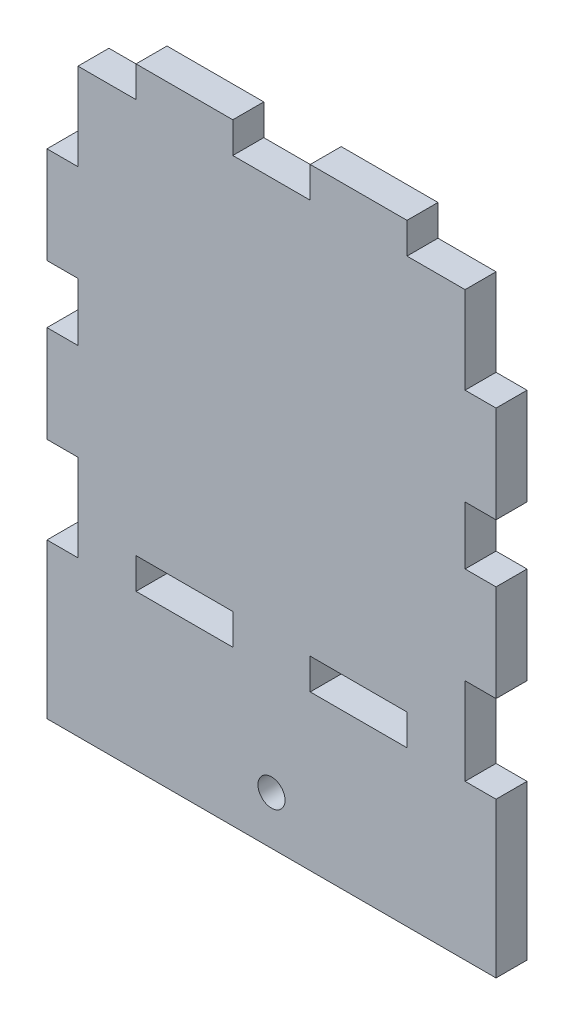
ISO-10303-21;
HEADER;
FILE_DESCRIPTION(('STEP AP214'),'2;1');
FILE_NAME('part.step','',(''),(''),'','','');
FILE_SCHEMA(('AUTOMOTIVE_DESIGN { 1 0 10303 214 1 1 1 1 }'));
ENDSEC;
DATA;
#1=APPLICATION_CONTEXT('core data for automotive mechanical design processes');
#2=APPLICATION_PROTOCOL_DEFINITION('international standard','automotive_design',2000,#1);
#3=PRODUCT_CONTEXT('',#1,'mechanical');
#4=PRODUCT('Part','Part','',(#3));
#5=PRODUCT_RELATED_PRODUCT_CATEGORY('part','',(#4));
#6=PRODUCT_DEFINITION_FORMATION('','',#4);
#7=PRODUCT_DEFINITION_CONTEXT('part definition',#1,'design');
#8=PRODUCT_DEFINITION('design','',#6,#7);
#9=PRODUCT_DEFINITION_SHAPE('','',#8);
#10=(LENGTH_UNIT() NAMED_UNIT(*) SI_UNIT(.MILLI.,.METRE.));
#11=(NAMED_UNIT(*) PLANE_ANGLE_UNIT() SI_UNIT($,.RADIAN.));
#12=(NAMED_UNIT(*) SI_UNIT($,.STERADIAN.) SOLID_ANGLE_UNIT());
#13=UNCERTAINTY_MEASURE_WITH_UNIT(LENGTH_MEASURE(1.E-05),#10,'distance_accuracy_value','');
#14=(GEOMETRIC_REPRESENTATION_CONTEXT(3) GLOBAL_UNCERTAINTY_ASSIGNED_CONTEXT((#13)) GLOBAL_UNIT_ASSIGNED_CONTEXT((#10,
#11,#12)) REPRESENTATION_CONTEXT('',''));
#15=CARTESIAN_POINT('',(0.,0.,0.));
#16=DIRECTION('',(0.,0.,1.));
#17=DIRECTION('',(1.,0.,0.));
#18=AXIS2_PLACEMENT_3D('',#15,#16,#17);
#19=CARTESIAN_POINT('',(80.,0.,-16.));
#20=DIRECTION('',(1.,0.,0.));
#21=DIRECTION('',(0.,0.,-1.));
#22=AXIS2_PLACEMENT_3D('',#19,#20,#21);
#23=PLANE('',#22);
#24=DIRECTION('',(0.,1.,0.));
#25=VECTOR('',#24,1.);
#26=CARTESIAN_POINT('',(80.,0.,0.));
#27=LINE('',#26,#25);
#28=CARTESIAN_POINT('',(80.,80.,0.));
#29=VERTEX_POINT('',#28);
#30=CARTESIAN_POINT('',(80.,96.,0.));
#31=VERTEX_POINT('',#30);
#32=EDGE_CURVE('E904',#29,#31,#27,.T.);
#33=ORIENTED_EDGE('',*,*,#32,.T.);
#34=DIRECTION('',(0.,0.,1.));
#35=VECTOR('',#34,1.);
#36=CARTESIAN_POINT('',(80.,96.,-16.));
#37=LINE('',#36,#35);
#38=CARTESIAN_POINT('',(80.,96.,-16.));
#39=VERTEX_POINT('',#38);
#40=EDGE_CURVE('E921',#39,#31,#37,.T.);
#41=ORIENTED_EDGE('',*,*,#40,.F.);
#42=DIRECTION('',(0.,1.,0.));
#43=VECTOR('',#42,1.);
#44=CARTESIAN_POINT('',(80.,0.,-16.));
#45=LINE('',#44,#43);
#46=CARTESIAN_POINT('',(80.,80.,-16.));
#47=VERTEX_POINT('',#46);
#48=EDGE_CURVE('E807',#47,#39,#45,.T.);
#49=ORIENTED_EDGE('',*,*,#48,.F.);
#50=DIRECTION('',(0.,0.,1.));
#51=VECTOR('',#50,1.);
#52=CARTESIAN_POINT('',(80.,80.,-16.));
#53=LINE('',#52,#51);
#54=EDGE_CURVE('E918',#47,#29,#53,.T.);
#55=ORIENTED_EDGE('',*,*,#54,.T.);
#56=EDGE_LOOP('',(#33,#41,#49,#55));
#57=FACE_BOUND('',#56,.T.);
#58=ADVANCED_FACE('F522',(#57),#23,.F.);
#59=CARTESIAN_POINT('',(0.,96.,-16.));
#60=DIRECTION('',(0.,-1.,0.));
#61=DIRECTION('',(1.,0.,0.));
#62=AXIS2_PLACEMENT_3D('',#59,#60,#61);
#63=PLANE('',#62);
#64=DIRECTION('',(1.,0.,0.));
#65=VECTOR('',#64,1.);
#66=CARTESIAN_POINT('',(0.,96.,0.));
#67=LINE('',#66,#65);
#68=CARTESIAN_POINT('',(30.,96.,0.));
#69=VERTEX_POINT('',#68);
#70=EDGE_CURVE('E901',#69,#31,#67,.T.);
#71=ORIENTED_EDGE('',*,*,#70,.F.);
#72=DIRECTION('',(0.,0.,1.));
#73=VECTOR('',#72,1.);
#74=CARTESIAN_POINT('',(30.,96.,-16.));
#75=LINE('',#74,#73);
#76=CARTESIAN_POINT('',(30.,96.,-16.));
#77=VERTEX_POINT('',#76);
#78=EDGE_CURVE('E923',#77,#69,#75,.T.);
#79=ORIENTED_EDGE('',*,*,#78,.F.);
#80=DIRECTION('',(1.,0.,0.));
#81=VECTOR('',#80,1.);
#82=CARTESIAN_POINT('',(0.,96.,-16.));
#83=LINE('',#82,#81);
#84=EDGE_CURVE('E1093',#77,#39,#83,.T.);
#85=ORIENTED_EDGE('',*,*,#84,.T.);
#86=ORIENTED_EDGE('',*,*,#40,.T.);
#87=EDGE_LOOP('',(#71,#79,#85,#86));
#88=FACE_BOUND('',#87,.T.);
#89=ADVANCED_FACE('F1104',(#88),#63,.T.);
#90=CARTESIAN_POINT('',(30.,0.,-16.));
#91=DIRECTION('',(1.,0.,0.));
#92=DIRECTION('',(0.,0.,-1.));
#93=AXIS2_PLACEMENT_3D('',#90,#91,#92);
#94=PLANE('',#93);
#95=DIRECTION('',(0.,1.,0.));
#96=VECTOR('',#95,1.);
#97=CARTESIAN_POINT('',(30.,0.,0.));
#98=LINE('',#97,#96);
#99=CARTESIAN_POINT('',(30.,80.,0.));
#100=VERTEX_POINT('',#99);
#101=EDGE_CURVE('E898',#100,#69,#98,.T.);
#102=ORIENTED_EDGE('',*,*,#101,.F.);
#103=DIRECTION('',(0.,0.,1.));
#104=VECTOR('',#103,1.);
#105=CARTESIAN_POINT('',(30.,80.,-16.));
#106=LINE('',#105,#104);
#107=CARTESIAN_POINT('',(30.,80.,-16.));
#108=VERTEX_POINT('',#107);
#109=EDGE_CURVE('E925',#108,#100,#106,.T.);
#110=ORIENTED_EDGE('',*,*,#109,.F.);
#111=DIRECTION('',(0.,1.,0.));
#112=VECTOR('',#111,1.);
#113=CARTESIAN_POINT('',(30.,0.,-16.));
#114=LINE('',#113,#112);
#115=EDGE_CURVE('E1090',#108,#77,#114,.T.);
#116=ORIENTED_EDGE('',*,*,#115,.T.);
#117=ORIENTED_EDGE('',*,*,#78,.T.);
#118=EDGE_LOOP('',(#102,#110,#116,#117));
#119=FACE_BOUND('',#118,.T.);
#120=ADVANCED_FACE('F1107',(#119),#94,.T.);
#121=CARTESIAN_POINT('',(0.,80.,-16.));
#122=DIRECTION('',(0.,-1.,0.));
#123=DIRECTION('',(0.,0.,-1.));
#124=AXIS2_PLACEMENT_3D('',#121,#122,#123);
#125=PLANE('',#124);
#126=DIRECTION('',(1.,0.,0.));
#127=VECTOR('',#126,1.);
#128=CARTESIAN_POINT('',(0.,80.,0.));
#129=LINE('',#128,#127);
#130=EDGE_CURVE('E895',#100,#29,#129,.T.);
#131=ORIENTED_EDGE('',*,*,#130,.T.);
#132=ORIENTED_EDGE('',*,*,#54,.F.);
#133=DIRECTION('',(1.,0.,0.));
#134=VECTOR('',#133,1.);
#135=CARTESIAN_POINT('',(0.,80.,-16.));
#136=LINE('',#135,#134);
#137=EDGE_CURVE('E1087',#108,#47,#136,.T.);
#138=ORIENTED_EDGE('',*,*,#137,.F.);
#139=ORIENTED_EDGE('',*,*,#109,.T.);
#140=EDGE_LOOP('',(#131,#132,#138,#139));
#141=FACE_BOUND('',#140,.T.);
#142=ADVANCED_FACE('F1110',(#141),#125,.F.);
#143=CARTESIAN_POINT('',(170.,0.,-16.));
#144=DIRECTION('',(1.,0.,0.));
#145=DIRECTION('',(0.,0.,-1.));
#146=AXIS2_PLACEMENT_3D('',#143,#144,#145);
#147=PLANE('',#146);
#148=DIRECTION('',(0.,1.,0.));
#149=VECTOR('',#148,1.);
#150=CARTESIAN_POINT('',(170.,0.,0.));
#151=LINE('',#150,#149);
#152=CARTESIAN_POINT('',(170.,80.,0.));
#153=VERTEX_POINT('',#152);
#154=CARTESIAN_POINT('',(170.,96.,0.));
#155=VERTEX_POINT('',#154);
#156=EDGE_CURVE('E913',#153,#155,#151,.T.);
#157=ORIENTED_EDGE('',*,*,#156,.T.);
#158=DIRECTION('',(0.,0.,1.));
#159=VECTOR('',#158,1.);
#160=CARTESIAN_POINT('',(170.,96.,-16.));
#161=LINE('',#160,#159);
#162=CARTESIAN_POINT('',(170.,96.,-16.));
#163=VERTEX_POINT('',#162);
#164=EDGE_CURVE('E532',#163,#155,#161,.T.);
#165=ORIENTED_EDGE('',*,*,#164,.F.);
#166=DIRECTION('',(0.,1.,0.));
#167=VECTOR('',#166,1.);
#168=CARTESIAN_POINT('',(170.,0.,-16.));
#169=LINE('',#168,#167);
#170=CARTESIAN_POINT('',(170.,80.,-16.));
#171=VERTEX_POINT('',#170);
#172=EDGE_CURVE('E794',#171,#163,#169,.T.);
#173=ORIENTED_EDGE('',*,*,#172,.F.);
#174=DIRECTION('',(0.,0.,1.));
#175=VECTOR('',#174,1.);
#176=CARTESIAN_POINT('',(170.,80.,-16.));
#177=LINE('',#176,#175);
#178=EDGE_CURVE('E12',#171,#153,#177,.T.);
#179=ORIENTED_EDGE('',*,*,#178,.T.);
#180=EDGE_LOOP('',(#157,#165,#173,#179));
#181=FACE_BOUND('',#180,.T.);
#182=ADVANCED_FACE('F1137',(#181),#147,.F.);
#183=CARTESIAN_POINT('',(0.,96.0000000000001,-16.));
#184=DIRECTION('',(0.,1.,0.));
#185=DIRECTION('',(-1.,0.,0.));
#186=AXIS2_PLACEMENT_3D('',#183,#184,#185);
#187=PLANE('',#186);
#188=DIRECTION('',(-1.,0.,0.));
#189=VECTOR('',#188,1.);
#190=CARTESIAN_POINT('',(0.,96.0000000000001,0.));
#191=LINE('',#190,#189);
#192=CARTESIAN_POINT('',(120.,96.,0.));
#193=VERTEX_POINT('',#192);
#194=EDGE_CURVE('E665',#155,#193,#191,.T.);
#195=ORIENTED_EDGE('',*,*,#194,.T.);
#196=DIRECTION('',(0.,0.,1.));
#197=VECTOR('',#196,1.);
#198=CARTESIAN_POINT('',(120.,96.,-16.));
#199=LINE('',#198,#197);
#200=CARTESIAN_POINT('',(120.,96.,-16.));
#201=VERTEX_POINT('',#200);
#202=EDGE_CURVE('E798',#201,#193,#199,.T.);
#203=ORIENTED_EDGE('',*,*,#202,.F.);
#204=DIRECTION('',(-1.,0.,0.));
#205=VECTOR('',#204,1.);
#206=CARTESIAN_POINT('',(0.,96.0000000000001,-16.));
#207=LINE('',#206,#205);
#208=EDGE_CURVE('E788',#163,#201,#207,.T.);
#209=ORIENTED_EDGE('',*,*,#208,.F.);
#210=ORIENTED_EDGE('',*,*,#164,.T.);
#211=EDGE_LOOP('',(#195,#203,#209,#210));
#212=FACE_BOUND('',#211,.T.);
#213=ADVANCED_FACE('F799',(#212),#187,.F.);
#214=CARTESIAN_POINT('',(120.,0.,-16.));
#215=DIRECTION('',(1.,0.,0.));
#216=DIRECTION('',(0.,0.,-1.));
#217=AXIS2_PLACEMENT_3D('',#214,#215,#216);
#218=PLANE('',#217);
#219=DIRECTION('',(0.,1.,0.));
#220=VECTOR('',#219,1.);
#221=CARTESIAN_POINT('',(120.,0.,0.));
#222=LINE('',#221,#220);
#223=CARTESIAN_POINT('',(120.,80.,0.));
#224=VERTEX_POINT('',#223);
#225=EDGE_CURVE('E910',#224,#193,#222,.T.);
#226=ORIENTED_EDGE('',*,*,#225,.F.);
#227=DIRECTION('',(0.,0.,1.));
#228=VECTOR('',#227,1.);
#229=CARTESIAN_POINT('',(120.,80.,-16.));
#230=LINE('',#229,#228);
#231=CARTESIAN_POINT('',(120.,80.,-16.));
#232=VERTEX_POINT('',#231);
#233=EDGE_CURVE('E802',#232,#224,#230,.T.);
#234=ORIENTED_EDGE('',*,*,#233,.F.);
#235=DIRECTION('',(0.,1.,0.));
#236=VECTOR('',#235,1.);
#237=CARTESIAN_POINT('',(120.,0.,-16.));
#238=LINE('',#237,#236);
#239=EDGE_CURVE('E793',#232,#201,#238,.T.);
#240=ORIENTED_EDGE('',*,*,#239,.T.);
#241=ORIENTED_EDGE('',*,*,#202,.T.);
#242=EDGE_LOOP('',(#226,#234,#240,#241));
#243=FACE_BOUND('',#242,.T.);
#244=ADVANCED_FACE('F804',(#243),#218,.T.);
#245=CARTESIAN_POINT('',(0.,80.,-16.));
#246=DIRECTION('',(0.,1.,0.));
#247=DIRECTION('',(0.,0.,1.));
#248=AXIS2_PLACEMENT_3D('',#245,#246,#247);
#249=PLANE('',#248);
#250=DIRECTION('',(-1.,0.,0.));
#251=VECTOR('',#250,1.);
#252=CARTESIAN_POINT('',(0.,80.,0.));
#253=LINE('',#252,#251);
#254=EDGE_CURVE('E907',#153,#224,#253,.T.);
#255=ORIENTED_EDGE('',*,*,#254,.F.);
#256=ORIENTED_EDGE('',*,*,#178,.F.);
#257=DIRECTION('',(-1.,0.,0.));
#258=VECTOR('',#257,1.);
#259=CARTESIAN_POINT('',(0.,80.,-16.));
#260=LINE('',#259,#258);
#261=EDGE_CURVE('E805',#171,#232,#260,.T.);
#262=ORIENTED_EDGE('',*,*,#261,.T.);
#263=ORIENTED_EDGE('',*,*,#233,.T.);
#264=EDGE_LOOP('',(#255,#256,#262,#263));
#265=FACE_BOUND('',#264,.T.);
#266=ADVANCED_FACE('F1115',(#265),#249,.T.);
#267=CARTESIAN_POINT('',(100.,25.,-16.));
#268=DIRECTION('',(0.,0.,1.));
#269=DIRECTION('',(1.,0.,0.));
#270=AXIS2_PLACEMENT_3D('',#267,#268,#269);
#271=CYLINDRICAL_SURFACE('',#270,7.);
#272=CARTESIAN_POINT('',(100.,25.,-16.));
#273=DIRECTION('',(0.,0.,1.));
#274=DIRECTION('',(1.,0.,0.));
#275=AXIS2_PLACEMENT_3D('',#272,#273,#274);
#276=CIRCLE('',#275,7.);
#277=CARTESIAN_POINT('',(107.,25.,-16.));
#278=VERTEX_POINT('',#277);
#279=EDGE_CURVE('E1012',#278,#278,#276,.T.);
#280=ORIENTED_EDGE('',*,*,#279,.F.);
#281=EDGE_LOOP('',(#280));
#282=FACE_BOUND('',#281,.T.);
#283=CARTESIAN_POINT('',(100.,25.,0.));
#284=DIRECTION('',(0.,0.,1.));
#285=DIRECTION('',(1.,0.,0.));
#286=AXIS2_PLACEMENT_3D('',#283,#284,#285);
#287=CIRCLE('',#286,7.);
#288=CARTESIAN_POINT('',(107.,25.,0.));
#289=VERTEX_POINT('',#288);
#290=EDGE_CURVE('E892',#289,#289,#287,.T.);
#291=ORIENTED_EDGE('',*,*,#290,.T.);
#292=EDGE_LOOP('',(#291));
#293=FACE_BOUND('',#292,.T.);
#294=ADVANCED_FACE('F1117',(#282,#293),#271,.F.);
#295=CARTESIAN_POINT('',(200.,0.,-16.));
#296=DIRECTION('',(1.,0.,0.));
#297=DIRECTION('',(0.,0.,-1.));
#298=AXIS2_PLACEMENT_3D('',#295,#296,#297);
#299=PLANE('',#298);
#300=DIRECTION('',(0.,1.,0.));
#301=VECTOR('',#300,1.);
#302=CARTESIAN_POINT('',(200.,0.,0.));
#303=LINE('',#302,#301);
#304=CARTESIAN_POINT('',(200.,255.,0.));
#305=VERTEX_POINT('',#304);
#306=CARTESIAN_POINT('',(200.,300.,0.));
#307=VERTEX_POINT('',#306);
#308=EDGE_CURVE('E860',#305,#307,#303,.T.);
#309=ORIENTED_EDGE('',*,*,#308,.F.);
#310=DIRECTION('',(0.,0.,1.));
#311=VECTOR('',#310,1.);
#312=CARTESIAN_POINT('',(200.,255.,-16.));
#313=LINE('',#312,#311);
#314=CARTESIAN_POINT('',(200.,255.,-16.));
#315=VERTEX_POINT('',#314);
#316=EDGE_CURVE('E944',#315,#305,#313,.T.);
#317=ORIENTED_EDGE('',*,*,#316,.F.);
#318=DIRECTION('',(0.,1.,0.));
#319=VECTOR('',#318,1.);
#320=CARTESIAN_POINT('',(200.,0.,-16.));
#321=LINE('',#320,#319);
#322=CARTESIAN_POINT('',(200.,300.,-16.));
#323=VERTEX_POINT('',#322);
#324=EDGE_CURVE('E1061',#315,#323,#321,.T.);
#325=ORIENTED_EDGE('',*,*,#324,.T.);
#326=DIRECTION('',(0.,0.,1.));
#327=VECTOR('',#326,1.);
#328=CARTESIAN_POINT('',(200.,300.,-16.));
#329=LINE('',#328,#327);
#330=EDGE_CURVE('E942',#323,#307,#329,.T.);
#331=ORIENTED_EDGE('',*,*,#330,.T.);
#332=EDGE_LOOP('',(#309,#317,#325,#331));
#333=FACE_BOUND('',#332,.T.);
#334=ADVANCED_FACE('F1123',(#333),#299,.T.);
#335=CARTESIAN_POINT('',(200.,175.,0.));
#336=VERTEX_POINT('',#335);
#337=CARTESIAN_POINT('',(200.,205.,0.));
#338=VERTEX_POINT('',#337);
#339=EDGE_CURVE('E861',#336,#338,#303,.T.);
#340=ORIENTED_EDGE('',*,*,#339,.F.);
#341=DIRECTION('',(0.,0.,1.));
#342=VECTOR('',#341,1.);
#343=CARTESIAN_POINT('',(200.,175.,-16.));
#344=LINE('',#343,#342);
#345=CARTESIAN_POINT('',(200.,175.,-16.));
#346=VERTEX_POINT('',#345);
#347=EDGE_CURVE('E953',#346,#336,#344,.T.);
#348=ORIENTED_EDGE('',*,*,#347,.F.);
#349=CARTESIAN_POINT('',(200.,205.,-16.));
#350=VERTEX_POINT('',#349);
#351=EDGE_CURVE('E1062',#346,#350,#321,.T.);
#352=ORIENTED_EDGE('',*,*,#351,.T.);
#353=DIRECTION('',(0.,0.,1.));
#354=VECTOR('',#353,1.);
#355=CARTESIAN_POINT('',(200.,205.,-16.));
#356=LINE('',#355,#354);
#357=EDGE_CURVE('E951',#350,#338,#356,.T.);
#358=ORIENTED_EDGE('',*,*,#357,.T.);
#359=EDGE_LOOP('',(#340,#348,#352,#358));
#360=FACE_BOUND('',#359,.T.);
#361=ADVANCED_FACE('F1165',(#360),#299,.T.);
#362=CARTESIAN_POINT('',(200.,80.,0.));
#363=VERTEX_POINT('',#362);
#364=CARTESIAN_POINT('',(200.,125.,0.));
#365=VERTEX_POINT('',#364);
#366=EDGE_CURVE('E856',#363,#365,#303,.T.);
#367=ORIENTED_EDGE('',*,*,#366,.F.);
#368=DIRECTION('',(0.,0.,1.));
#369=VECTOR('',#368,1.);
#370=CARTESIAN_POINT('',(200.,80.,-16.));
#371=LINE('',#370,#369);
#372=CARTESIAN_POINT('',(200.,80.,-16.));
#373=VERTEX_POINT('',#372);
#374=EDGE_CURVE('E962',#373,#363,#371,.T.);
#375=ORIENTED_EDGE('',*,*,#374,.F.);
#376=CARTESIAN_POINT('',(200.,125.,-16.));
#377=VERTEX_POINT('',#376);
#378=EDGE_CURVE('E1057',#373,#377,#321,.T.);
#379=ORIENTED_EDGE('',*,*,#378,.T.);
#380=DIRECTION('',(0.,0.,1.));
#381=VECTOR('',#380,1.);
#382=CARTESIAN_POINT('',(200.,125.,-16.));
#383=LINE('',#382,#381);
#384=EDGE_CURVE('E960',#377,#365,#383,.T.);
#385=ORIENTED_EDGE('',*,*,#384,.T.);
#386=EDGE_LOOP('',(#367,#375,#379,#385));
#387=FACE_BOUND('',#386,.T.);
#388=ADVANCED_FACE('F1167',(#387),#299,.T.);
#389=CARTESIAN_POINT('',(0.,300.,-16.));
#390=DIRECTION('',(0.,-1.,0.));
#391=DIRECTION('',(0.,0.,-1.));
#392=AXIS2_PLACEMENT_3D('',#389,#390,#391);
#393=PLANE('',#392);
#394=DIRECTION('',(1.,0.,0.));
#395=VECTOR('',#394,1.);
#396=CARTESIAN_POINT('',(0.,300.,0.));
#397=LINE('',#396,#395);
#398=CARTESIAN_POINT('',(170.,300.,0.));
#399=VERTEX_POINT('',#398);
#400=EDGE_CURVE('E819',#399,#307,#397,.T.);
#401=ORIENTED_EDGE('',*,*,#400,.T.);
#402=ORIENTED_EDGE('',*,*,#330,.F.);
#403=DIRECTION('',(1.,0.,0.));
#404=VECTOR('',#403,1.);
#405=CARTESIAN_POINT('',(0.,300.,-16.));
#406=LINE('',#405,#404);
#407=CARTESIAN_POINT('',(170.,300.,-16.));
#408=VERTEX_POINT('',#407);
#409=EDGE_CURVE('E1023',#408,#323,#406,.T.);
#410=ORIENTED_EDGE('',*,*,#409,.F.);
#411=DIRECTION('',(0.,0.,1.));
#412=VECTOR('',#411,1.);
#413=CARTESIAN_POINT('',(170.,300.,-16.));
#414=LINE('',#413,#412);
#415=EDGE_CURVE('E940',#408,#399,#414,.T.);
#416=ORIENTED_EDGE('',*,*,#415,.T.);
#417=EDGE_LOOP('',(#401,#402,#410,#416));
#418=FACE_BOUND('',#417,.T.);
#419=ADVANCED_FACE('F1149',(#418),#393,.F.);
#420=CARTESIAN_POINT('',(80.,300.,0.));
#421=VERTEX_POINT('',#420);
#422=CARTESIAN_POINT('',(120.,300.,0.));
#423=VERTEX_POINT('',#422);
#424=EDGE_CURVE('E818',#421,#423,#397,.T.);
#425=ORIENTED_EDGE('',*,*,#424,.T.);
#426=DIRECTION('',(0.,0.,1.));
#427=VECTOR('',#426,1.);
#428=CARTESIAN_POINT('',(120.,300.,-16.));
#429=LINE('',#428,#427);
#430=CARTESIAN_POINT('',(120.,300.,-16.));
#431=VERTEX_POINT('',#430);
#432=EDGE_CURVE('E934',#431,#423,#429,.T.);
#433=ORIENTED_EDGE('',*,*,#432,.F.);
#434=CARTESIAN_POINT('',(80.,300.,-16.));
#435=VERTEX_POINT('',#434);
#436=EDGE_CURVE('E1022',#435,#431,#406,.T.);
#437=ORIENTED_EDGE('',*,*,#436,.F.);
#438=DIRECTION('',(0.,0.,1.));
#439=VECTOR('',#438,1.);
#440=CARTESIAN_POINT('',(80.,300.,-16.));
#441=LINE('',#440,#439);
#442=EDGE_CURVE('E932',#435,#421,#441,.T.);
#443=ORIENTED_EDGE('',*,*,#442,.T.);
#444=EDGE_LOOP('',(#425,#433,#437,#443));
#445=FACE_BOUND('',#444,.T.);
#446=ADVANCED_FACE('F1143',(#445),#393,.F.);
#447=CARTESIAN_POINT('',(0.,300.,0.));
#448=VERTEX_POINT('',#447);
#449=CARTESIAN_POINT('',(30.,300.,0.));
#450=VERTEX_POINT('',#449);
#451=EDGE_CURVE('E815',#448,#450,#397,.T.);
#452=ORIENTED_EDGE('',*,*,#451,.T.);
#453=DIRECTION('',(0.,0.,1.));
#454=VECTOR('',#453,1.);
#455=CARTESIAN_POINT('',(30.,300.,-16.));
#456=LINE('',#455,#454);
#457=CARTESIAN_POINT('',(30.,300.,-16.));
#458=VERTEX_POINT('',#457);
#459=EDGE_CURVE('E526',#458,#450,#456,.T.);
#460=ORIENTED_EDGE('',*,*,#459,.F.);
#461=CARTESIAN_POINT('',(0.,300.,-16.));
#462=VERTEX_POINT('',#461);
#463=EDGE_CURVE('E1018',#462,#458,#406,.T.);
#464=ORIENTED_EDGE('',*,*,#463,.F.);
#465=DIRECTION('',(0.,0.,1.));
#466=VECTOR('',#465,1.);
#467=CARTESIAN_POINT('',(0.,300.,-16.));
#468=LINE('',#467,#466);
#469=EDGE_CURVE('E990',#462,#448,#468,.T.);
#470=ORIENTED_EDGE('',*,*,#469,.T.);
#471=EDGE_LOOP('',(#452,#460,#464,#470));
#472=FACE_BOUND('',#471,.T.);
#473=ADVANCED_FACE('F997',(#472),#393,.F.);
#474=CARTESIAN_POINT('',(0.,0.,-16.));
#475=DIRECTION('',(-1.,0.,0.));
#476=DIRECTION('',(0.,0.,1.));
#477=AXIS2_PLACEMENT_3D('',#474,#475,#476);
#478=PLANE('',#477);
#479=DIRECTION('',(0.,-1.,0.));
#480=VECTOR('',#479,1.);
#481=CARTESIAN_POINT('',(0.,0.,0.));
#482=LINE('',#481,#480);
#483=CARTESIAN_POINT('',(0.,125.,0.));
#484=VERTEX_POINT('',#483);
#485=CARTESIAN_POINT('',(0.,80.,0.));
#486=VERTEX_POINT('',#485);
#487=EDGE_CURVE('E823',#484,#486,#482,.T.);
#488=ORIENTED_EDGE('',*,*,#487,.F.);
#489=DIRECTION('',(0.,0.,1.));
#490=VECTOR('',#489,1.);
#491=CARTESIAN_POINT('',(0.,125.,-16.));
#492=LINE('',#491,#490);
#493=CARTESIAN_POINT('',(0.,125.,-16.));
#494=VERTEX_POINT('',#493);
#495=EDGE_CURVE('E975',#494,#484,#492,.T.);
#496=ORIENTED_EDGE('',*,*,#495,.F.);
#497=DIRECTION('',(0.,-1.,0.));
#498=VECTOR('',#497,1.);
#499=CARTESIAN_POINT('',(0.,0.,-16.));
#500=LINE('',#499,#498);
#501=CARTESIAN_POINT('',(0.,80.,-16.));
#502=VERTEX_POINT('',#501);
#503=EDGE_CURVE('E1028',#494,#502,#500,.T.);
#504=ORIENTED_EDGE('',*,*,#503,.T.);
#505=DIRECTION('',(0.,0.,1.));
#506=VECTOR('',#505,1.);
#507=CARTESIAN_POINT('',(0.,80.,-16.));
#508=LINE('',#507,#506);
#509=EDGE_CURVE('E973',#502,#486,#508,.T.);
#510=ORIENTED_EDGE('',*,*,#509,.T.);
#511=EDGE_LOOP('',(#488,#496,#504,#510));
#512=FACE_BOUND('',#511,.T.);
#513=ADVANCED_FACE('F1212',(#512),#478,.T.);
#514=CARTESIAN_POINT('',(0.,205.,0.));
#515=VERTEX_POINT('',#514);
#516=CARTESIAN_POINT('',(0.,175.,0.));
#517=VERTEX_POINT('',#516);
#518=EDGE_CURVE('E824',#515,#517,#482,.T.);
#519=ORIENTED_EDGE('',*,*,#518,.F.);
#520=DIRECTION('',(0.,0.,1.));
#521=VECTOR('',#520,1.);
#522=CARTESIAN_POINT('',(0.,205.,-16.));
#523=LINE('',#522,#521);
#524=CARTESIAN_POINT('',(0.,205.,-16.));
#525=VERTEX_POINT('',#524);
#526=EDGE_CURVE('E983',#525,#515,#523,.T.);
#527=ORIENTED_EDGE('',*,*,#526,.F.);
#528=CARTESIAN_POINT('',(0.,175.,-16.));
#529=VERTEX_POINT('',#528);
#530=EDGE_CURVE('E1029',#525,#529,#500,.T.);
#531=ORIENTED_EDGE('',*,*,#530,.T.);
#532=DIRECTION('',(0.,0.,1.));
#533=VECTOR('',#532,1.);
#534=CARTESIAN_POINT('',(0.,175.,-16.));
#535=LINE('',#534,#533);
#536=EDGE_CURVE('E981',#529,#517,#535,.T.);
#537=ORIENTED_EDGE('',*,*,#536,.T.);
#538=EDGE_LOOP('',(#519,#527,#531,#537));
#539=FACE_BOUND('',#538,.T.);
#540=ADVANCED_FACE('F1215',(#539),#478,.T.);
#541=CARTESIAN_POINT('',(0.,255.,0.));
#542=VERTEX_POINT('',#541);
#543=EDGE_CURVE('E817',#448,#542,#482,.T.);
#544=ORIENTED_EDGE('',*,*,#543,.F.);
#545=ORIENTED_EDGE('',*,*,#469,.F.);
#546=CARTESIAN_POINT('',(0.,255.,-16.));
#547=VERTEX_POINT('',#546);
#548=EDGE_CURVE('E1020',#462,#547,#500,.T.);
#549=ORIENTED_EDGE('',*,*,#548,.T.);
#550=DIRECTION('',(0.,0.,1.));
#551=VECTOR('',#550,1.);
#552=CARTESIAN_POINT('',(0.,255.,-16.));
#553=LINE('',#552,#551);
#554=EDGE_CURVE('E989',#547,#542,#553,.T.);
#555=ORIENTED_EDGE('',*,*,#554,.T.);
#556=EDGE_LOOP('',(#544,#545,#549,#555));
#557=FACE_BOUND('',#556,.T.);
#558=ADVANCED_FACE('F1172',(#557),#478,.T.);
#559=CARTESIAN_POINT('',(8.84708972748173E-13,255.000000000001,-16.));
#560=DIRECTION('',(0.,-1.,0.));
#561=DIRECTION('',(1.,0.,0.));
#562=AXIS2_PLACEMENT_3D('',#559,#560,#561);
#563=PLANE('',#562);
#564=DIRECTION('',(1.,0.,0.));
#565=VECTOR('',#564,1.);
#566=CARTESIAN_POINT('',(8.84708972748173E-13,255.000000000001,0.));
#567=LINE('',#566,#565);
#568=CARTESIAN_POINT('',(216.,255.,0.));
#569=VERTEX_POINT('',#568);
#570=EDGE_CURVE('E875',#305,#569,#567,.T.);
#571=ORIENTED_EDGE('',*,*,#570,.T.);
#572=DIRECTION('',(0.,0.,1.));
#573=VECTOR('',#572,1.);
#574=CARTESIAN_POINT('',(216.,255.,-16.));
#575=LINE('',#574,#573);
#576=CARTESIAN_POINT('',(216.,255.,-16.));
#577=VERTEX_POINT('',#576);
#578=EDGE_CURVE('E946',#577,#569,#575,.T.);
#579=ORIENTED_EDGE('',*,*,#578,.F.);
#580=DIRECTION('',(1.,0.,0.));
#581=VECTOR('',#580,1.);
#582=CARTESIAN_POINT('',(8.84708972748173E-13,255.000000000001,-16.));
#583=LINE('',#582,#581);
#584=EDGE_CURVE('E1074',#315,#577,#583,.T.);
#585=ORIENTED_EDGE('',*,*,#584,.F.);
#586=ORIENTED_EDGE('',*,*,#316,.T.);
#587=EDGE_LOOP('',(#571,#579,#585,#586));
#588=FACE_BOUND('',#587,.T.);
#589=ADVANCED_FACE('F1168',(#588),#563,.F.);
#590=CARTESIAN_POINT('',(216.,-1.19904086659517E-13,-16.));
#591=DIRECTION('',(-1.,0.,0.));
#592=DIRECTION('',(0.,-1.,0.));
#593=AXIS2_PLACEMENT_3D('',#590,#591,#592);
#594=PLANE('',#593);
#595=DIRECTION('',(0.,-1.,0.));
#596=VECTOR('',#595,1.);
#597=CARTESIAN_POINT('',(216.,-1.19904086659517E-13,0.));
#598=LINE('',#597,#596);
#599=CARTESIAN_POINT('',(216.,205.,0.));
#600=VERTEX_POINT('',#599);
#601=EDGE_CURVE('E872',#569,#600,#598,.T.);
#602=ORIENTED_EDGE('',*,*,#601,.T.);
#603=DIRECTION('',(0.,0.,1.));
#604=VECTOR('',#603,1.);
#605=CARTESIAN_POINT('',(216.,205.,-16.));
#606=LINE('',#605,#604);
#607=CARTESIAN_POINT('',(216.,205.,-16.));
#608=VERTEX_POINT('',#607);
#609=EDGE_CURVE('E949',#608,#600,#606,.T.);
#610=ORIENTED_EDGE('',*,*,#609,.F.);
#611=DIRECTION('',(0.,-1.,0.));
#612=VECTOR('',#611,1.);
#613=CARTESIAN_POINT('',(216.,-1.19904086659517E-13,-16.));
#614=LINE('',#613,#612);
#615=EDGE_CURVE('E1072',#577,#608,#614,.T.);
#616=ORIENTED_EDGE('',*,*,#615,.F.);
#617=ORIENTED_EDGE('',*,*,#578,.T.);
#618=EDGE_LOOP('',(#602,#610,#616,#617));
#619=FACE_BOUND('',#618,.T.);
#620=ADVANCED_FACE('F1171',(#619),#594,.F.);
#621=CARTESIAN_POINT('',(0.,205.,-16.));
#622=DIRECTION('',(0.,-1.,0.));
#623=DIRECTION('',(0.,0.,-1.));
#624=AXIS2_PLACEMENT_3D('',#621,#622,#623);
#625=PLANE('',#624);
#626=DIRECTION('',(1.,0.,0.));
#627=VECTOR('',#626,1.);
#628=CARTESIAN_POINT('',(0.,205.,0.));
#629=LINE('',#628,#627);
#630=EDGE_CURVE('E869',#338,#600,#629,.T.);
#631=ORIENTED_EDGE('',*,*,#630,.F.);
#632=ORIENTED_EDGE('',*,*,#357,.F.);
#633=DIRECTION('',(1.,0.,0.));
#634=VECTOR('',#633,1.);
#635=CARTESIAN_POINT('',(0.,205.,-16.));
#636=LINE('',#635,#634);
#637=EDGE_CURVE('E1069',#350,#608,#636,.T.);
#638=ORIENTED_EDGE('',*,*,#637,.T.);
#639=ORIENTED_EDGE('',*,*,#609,.T.);
#640=EDGE_LOOP('',(#631,#632,#638,#639));
#641=FACE_BOUND('',#640,.T.);
#642=ADVANCED_FACE('F1113',(#641),#625,.T.);
#643=CARTESIAN_POINT('',(0.,0.,0.));
#644=DIRECTION('',(0.,0.,1.));
#645=DIRECTION('',(1.,0.,0.));
#646=AXIS2_PLACEMENT_3D('',#643,#644,#645);
#647=PLANE('',#646);
#648=ORIENTED_EDGE('',*,*,#570,.F.);
#649=ORIENTED_EDGE('',*,*,#308,.T.);
#650=ORIENTED_EDGE('',*,*,#400,.F.);
#651=DIRECTION('',(0.,1.,0.));
#652=VECTOR('',#651,1.);
#653=CARTESIAN_POINT('',(170.,0.,0.));
#654=LINE('',#653,#652);
#655=CARTESIAN_POINT('',(170.,316.,0.));
#656=VERTEX_POINT('',#655);
#657=EDGE_CURVE('E877',#399,#656,#654,.T.);
#658=ORIENTED_EDGE('',*,*,#657,.T.);
#659=DIRECTION('',(-1.,0.,0.));
#660=VECTOR('',#659,1.);
#661=CARTESIAN_POINT('',(0.,316.,0.));
#662=LINE('',#661,#660);
#663=CARTESIAN_POINT('',(120.,316.,0.));
#664=VERTEX_POINT('',#663);
#665=EDGE_CURVE('E880',#656,#664,#662,.T.);
#666=ORIENTED_EDGE('',*,*,#665,.T.);
#667=DIRECTION('',(0.,1.,0.));
#668=VECTOR('',#667,1.);
#669=CARTESIAN_POINT('',(120.,0.,0.));
#670=LINE('',#669,#668);
#671=EDGE_CURVE('E883',#423,#664,#670,.T.);
#672=ORIENTED_EDGE('',*,*,#671,.F.);
#673=ORIENTED_EDGE('',*,*,#424,.F.);
#674=DIRECTION('',(0.,1.,0.));
#675=VECTOR('',#674,1.);
#676=CARTESIAN_POINT('',(80.,0.,0.));
#677=LINE('',#676,#675);
#678=CARTESIAN_POINT('',(80.,316.,0.));
#679=VERTEX_POINT('',#678);
#680=EDGE_CURVE('E886',#421,#679,#677,.T.);
#681=ORIENTED_EDGE('',*,*,#680,.T.);
#682=DIRECTION('',(1.,0.,0.));
#683=VECTOR('',#682,1.);
#684=CARTESIAN_POINT('',(0.,316.,0.));
#685=LINE('',#684,#683);
#686=CARTESIAN_POINT('',(30.,316.,0.));
#687=VERTEX_POINT('',#686);
#688=EDGE_CURVE('E889',#687,#679,#685,.T.);
#689=ORIENTED_EDGE('',*,*,#688,.F.);
#690=DIRECTION('',(0.,1.,0.));
#691=VECTOR('',#690,1.);
#692=CARTESIAN_POINT('',(30.,0.,0.));
#693=LINE('',#692,#691);
#694=EDGE_CURVE('E812',#450,#687,#693,.T.);
#695=ORIENTED_EDGE('',*,*,#694,.F.);
#696=ORIENTED_EDGE('',*,*,#451,.F.);
#697=ORIENTED_EDGE('',*,*,#543,.T.);
#698=DIRECTION('',(-1.,0.,0.));
#699=VECTOR('',#698,1.);
#700=CARTESIAN_POINT('',(-8.84708972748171E-13,255.,0.));
#701=LINE('',#700,#699);
#702=CARTESIAN_POINT('',(-16.,255.,0.));
#703=VERTEX_POINT('',#702);
#704=EDGE_CURVE('E822',#542,#703,#701,.T.);
#705=ORIENTED_EDGE('',*,*,#704,.T.);
#706=DIRECTION('',(0.,-1.,0.));
#707=VECTOR('',#706,1.);
#708=CARTESIAN_POINT('',(-15.9999999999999,0.,0.));
#709=LINE('',#708,#707);
#710=CARTESIAN_POINT('',(-16.,205.,0.));
#711=VERTEX_POINT('',#710);
#712=EDGE_CURVE('E827',#703,#711,#709,.T.);
#713=ORIENTED_EDGE('',*,*,#712,.T.);
#714=DIRECTION('',(-1.,0.,0.));
#715=VECTOR('',#714,1.);
#716=CARTESIAN_POINT('',(0.,205.,0.));
#717=LINE('',#716,#715);
#718=EDGE_CURVE('E830',#515,#711,#717,.T.);
#719=ORIENTED_EDGE('',*,*,#718,.F.);
#720=ORIENTED_EDGE('',*,*,#518,.T.);
#721=DIRECTION('',(-1.,0.,0.));
#722=VECTOR('',#721,1.);
#723=CARTESIAN_POINT('',(3.03576608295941E-13,175.,0.));
#724=LINE('',#723,#722);
#725=CARTESIAN_POINT('',(-16.,175.,0.));
#726=VERTEX_POINT('',#725);
#727=EDGE_CURVE('E833',#517,#726,#724,.T.);
#728=ORIENTED_EDGE('',*,*,#727,.T.);
#729=DIRECTION('',(0.,-1.,0.));
#730=VECTOR('',#729,1.);
#731=CARTESIAN_POINT('',(-15.9999999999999,0.,0.));
#732=LINE('',#731,#730);
#733=CARTESIAN_POINT('',(-16.,125.,0.));
#734=VERTEX_POINT('',#733);
#735=EDGE_CURVE('E836',#726,#734,#732,.T.);
#736=ORIENTED_EDGE('',*,*,#735,.T.);
#737=DIRECTION('',(-1.,0.,0.));
#738=VECTOR('',#737,1.);
#739=CARTESIAN_POINT('',(0.,125.,0.));
#740=LINE('',#739,#738);
#741=EDGE_CURVE('E839',#484,#734,#740,.T.);
#742=ORIENTED_EDGE('',*,*,#741,.F.);
#743=ORIENTED_EDGE('',*,*,#487,.T.);
#744=DIRECTION('',(-1.,0.,0.));
#745=VECTOR('',#744,1.);
#746=CARTESIAN_POINT('',(0.,80.,0.));
#747=LINE('',#746,#745);
#748=CARTESIAN_POINT('',(-16.0000000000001,80.,0.));
#749=VERTEX_POINT('',#748);
#750=EDGE_CURVE('E842',#486,#749,#747,.T.);
#751=ORIENTED_EDGE('',*,*,#750,.T.);
#752=DIRECTION('',(0.,1.,0.));
#753=VECTOR('',#752,1.);
#754=CARTESIAN_POINT('',(-16.0000000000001,0.,0.));
#755=LINE('',#754,#753);
#756=CARTESIAN_POINT('',(-16.0000000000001,0.,0.));
#757=VERTEX_POINT('',#756);
#758=EDGE_CURVE('E845',#757,#749,#755,.T.);
#759=ORIENTED_EDGE('',*,*,#758,.F.);
#760=DIRECTION('',(1.,0.,0.));
#761=VECTOR('',#760,1.);
#762=CARTESIAN_POINT('',(0.,0.,0.));
#763=LINE('',#762,#761);
#764=CARTESIAN_POINT('',(216.,0.,0.));
#765=VERTEX_POINT('',#764);
#766=EDGE_CURVE('E848',#757,#765,#763,.T.);
#767=ORIENTED_EDGE('',*,*,#766,.T.);
#768=DIRECTION('',(0.,1.,0.));
#769=VECTOR('',#768,1.);
#770=CARTESIAN_POINT('',(216.,0.,0.));
#771=LINE('',#770,#769);
#772=CARTESIAN_POINT('',(216.,80.,0.));
#773=VERTEX_POINT('',#772);
#774=EDGE_CURVE('E850',#765,#773,#771,.T.);
#775=ORIENTED_EDGE('',*,*,#774,.T.);
#776=DIRECTION('',(1.,0.,0.));
#777=VECTOR('',#776,1.);
#778=CARTESIAN_POINT('',(0.,80.,0.));
#779=LINE('',#778,#777);
#780=EDGE_CURVE('E853',#363,#773,#779,.T.);
#781=ORIENTED_EDGE('',*,*,#780,.F.);
#782=ORIENTED_EDGE('',*,*,#366,.T.);
#783=DIRECTION('',(1.,0.,0.));
#784=VECTOR('',#783,1.);
#785=CARTESIAN_POINT('',(0.,125.,0.));
#786=LINE('',#785,#784);
#787=CARTESIAN_POINT('',(216.,125.,0.));
#788=VERTEX_POINT('',#787);
#789=EDGE_CURVE('E859',#365,#788,#786,.T.);
#790=ORIENTED_EDGE('',*,*,#789,.T.);
#791=DIRECTION('',(0.,-1.,0.));
#792=VECTOR('',#791,1.);
#793=CARTESIAN_POINT('',(216.,-1.19904086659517E-13,0.));
#794=LINE('',#793,#792);
#795=CARTESIAN_POINT('',(216.,175.,0.));
#796=VERTEX_POINT('',#795);
#797=EDGE_CURVE('E864',#796,#788,#794,.T.);
#798=ORIENTED_EDGE('',*,*,#797,.F.);
#799=DIRECTION('',(1.,0.,0.));
#800=VECTOR('',#799,1.);
#801=CARTESIAN_POINT('',(-3.0357660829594E-13,175.,0.));
#802=LINE('',#801,#800);
#803=EDGE_CURVE('E867',#336,#796,#802,.T.);
#804=ORIENTED_EDGE('',*,*,#803,.F.);
#805=ORIENTED_EDGE('',*,*,#339,.T.);
#806=ORIENTED_EDGE('',*,*,#630,.T.);
#807=ORIENTED_EDGE('',*,*,#601,.F.);
#808=EDGE_LOOP('',(#648,#649,#650,#658,#666,#672,#673,#681,#689,#695,#696,#697,#705,#713,#719,
#720,#728,#736,#742,#743,#751,#759,#767,#775,#781,#782,#790,#798,#804,#805,#806,#807));
#809=FACE_BOUND('',#808,.T.);
#810=ORIENTED_EDGE('',*,*,#290,.F.);
#811=EDGE_LOOP('',(#810));
#812=FACE_BOUND('',#811,.T.);
#813=ORIENTED_EDGE('',*,*,#130,.F.);
#814=ORIENTED_EDGE('',*,*,#101,.T.);
#815=ORIENTED_EDGE('',*,*,#70,.T.);
#816=ORIENTED_EDGE('',*,*,#32,.F.);
#817=EDGE_LOOP('',(#813,#814,#815,#816));
#818=FACE_BOUND('',#817,.T.);
#819=ORIENTED_EDGE('',*,*,#254,.T.);
#820=ORIENTED_EDGE('',*,*,#225,.T.);
#821=ORIENTED_EDGE('',*,*,#194,.F.);
#822=ORIENTED_EDGE('',*,*,#156,.F.);
#823=EDGE_LOOP('',(#819,#820,#821,#822));
#824=FACE_BOUND('',#823,.T.);
#825=ADVANCED_FACE('F1001',(#809,#812,#818,#824),#647,.T.);
#826=CARTESIAN_POINT('',(0.,0.,-16.));
#827=DIRECTION('',(0.,0.,1.));
#828=DIRECTION('',(1.,0.,0.));
#829=AXIS2_PLACEMENT_3D('',#826,#827,#828);
#830=PLANE('',#829);
#831=ORIENTED_EDGE('',*,*,#637,.F.);
#832=ORIENTED_EDGE('',*,*,#351,.F.);
#833=DIRECTION('',(1.,0.,0.));
#834=VECTOR('',#833,1.);
#835=CARTESIAN_POINT('',(-3.0357660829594E-13,175.,-16.));
#836=LINE('',#835,#834);
#837=CARTESIAN_POINT('',(216.,175.,-16.));
#838=VERTEX_POINT('',#837);
#839=EDGE_CURVE('E1067',#346,#838,#836,.T.);
#840=ORIENTED_EDGE('',*,*,#839,.T.);
#841=DIRECTION('',(0.,-1.,0.));
#842=VECTOR('',#841,1.);
#843=CARTESIAN_POINT('',(216.,-1.19904086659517E-13,-16.));
#844=LINE('',#843,#842);
#845=CARTESIAN_POINT('',(216.,125.,-16.));
#846=VERTEX_POINT('',#845);
#847=EDGE_CURVE('E1065',#838,#846,#844,.T.);
#848=ORIENTED_EDGE('',*,*,#847,.T.);
#849=DIRECTION('',(1.,0.,0.));
#850=VECTOR('',#849,1.);
#851=CARTESIAN_POINT('',(0.,125.,-16.));
#852=LINE('',#851,#850);
#853=EDGE_CURVE('E1060',#377,#846,#852,.T.);
#854=ORIENTED_EDGE('',*,*,#853,.F.);
#855=ORIENTED_EDGE('',*,*,#378,.F.);
#856=DIRECTION('',(1.,0.,0.));
#857=VECTOR('',#856,1.);
#858=CARTESIAN_POINT('',(0.,80.,-16.));
#859=LINE('',#858,#857);
#860=CARTESIAN_POINT('',(216.,80.,-16.));
#861=VERTEX_POINT('',#860);
#862=EDGE_CURVE('E1055',#373,#861,#859,.T.);
#863=ORIENTED_EDGE('',*,*,#862,.T.);
#864=DIRECTION('',(0.,1.,0.));
#865=VECTOR('',#864,1.);
#866=CARTESIAN_POINT('',(216.,0.,-16.));
#867=LINE('',#866,#865);
#868=CARTESIAN_POINT('',(216.,0.,-16.));
#869=VERTEX_POINT('',#868);
#870=EDGE_CURVE('E1052',#869,#861,#867,.T.);
#871=ORIENTED_EDGE('',*,*,#870,.F.);
#872=DIRECTION('',(1.,0.,0.));
#873=VECTOR('',#872,1.);
#874=CARTESIAN_POINT('',(0.,0.,-16.));
#875=LINE('',#874,#873);
#876=CARTESIAN_POINT('',(-16.0000000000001,0.,-16.));
#877=VERTEX_POINT('',#876);
#878=EDGE_CURVE('E1050',#877,#869,#875,.T.);
#879=ORIENTED_EDGE('',*,*,#878,.F.);
#880=DIRECTION('',(0.,1.,0.));
#881=VECTOR('',#880,1.);
#882=CARTESIAN_POINT('',(-16.0000000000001,0.,-16.));
#883=LINE('',#882,#881);
#884=CARTESIAN_POINT('',(-16.0000000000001,80.,-16.));
#885=VERTEX_POINT('',#884);
#886=EDGE_CURVE('E1048',#877,#885,#883,.T.);
#887=ORIENTED_EDGE('',*,*,#886,.T.);
#888=DIRECTION('',(-1.,0.,0.));
#889=VECTOR('',#888,1.);
#890=CARTESIAN_POINT('',(0.,80.,-16.));
#891=LINE('',#890,#889);
#892=EDGE_CURVE('E1045',#502,#885,#891,.T.);
#893=ORIENTED_EDGE('',*,*,#892,.F.);
#894=ORIENTED_EDGE('',*,*,#503,.F.);
#895=DIRECTION('',(-1.,0.,0.));
#896=VECTOR('',#895,1.);
#897=CARTESIAN_POINT('',(0.,125.,-16.));
#898=LINE('',#897,#896);
#899=CARTESIAN_POINT('',(-16.,125.,-16.));
#900=VERTEX_POINT('',#899);
#901=EDGE_CURVE('E1043',#494,#900,#898,.T.);
#902=ORIENTED_EDGE('',*,*,#901,.T.);
#903=DIRECTION('',(0.,-1.,0.));
#904=VECTOR('',#903,1.);
#905=CARTESIAN_POINT('',(-15.9999999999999,0.,-16.));
#906=LINE('',#905,#904);
#907=CARTESIAN_POINT('',(-16.,175.,-16.));
#908=VERTEX_POINT('',#907);
#909=EDGE_CURVE('E1040',#908,#900,#906,.T.);
#910=ORIENTED_EDGE('',*,*,#909,.F.);
#911=DIRECTION('',(-1.,0.,0.));
#912=VECTOR('',#911,1.);
#913=CARTESIAN_POINT('',(3.03576608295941E-13,175.,-16.));
#914=LINE('',#913,#912);
#915=EDGE_CURVE('E1037',#529,#908,#914,.T.);
#916=ORIENTED_EDGE('',*,*,#915,.F.);
#917=ORIENTED_EDGE('',*,*,#530,.F.);
#918=DIRECTION('',(-1.,0.,0.));
#919=VECTOR('',#918,1.);
#920=CARTESIAN_POINT('',(0.,205.,-16.));
#921=LINE('',#920,#919);
#922=CARTESIAN_POINT('',(-16.,205.,-16.));
#923=VERTEX_POINT('',#922);
#924=EDGE_CURVE('E1035',#525,#923,#921,.T.);
#925=ORIENTED_EDGE('',*,*,#924,.T.);
#926=DIRECTION('',(0.,-1.,0.));
#927=VECTOR('',#926,1.);
#928=CARTESIAN_POINT('',(-15.9999999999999,0.,-16.));
#929=LINE('',#928,#927);
#930=CARTESIAN_POINT('',(-16.,255.,-16.));
#931=VERTEX_POINT('',#930);
#932=EDGE_CURVE('E1032',#931,#923,#929,.T.);
#933=ORIENTED_EDGE('',*,*,#932,.F.);
#934=DIRECTION('',(-1.,0.,0.));
#935=VECTOR('',#934,1.);
#936=CARTESIAN_POINT('',(-8.84708972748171E-13,255.,-16.));
#937=LINE('',#936,#935);
#938=EDGE_CURVE('E1027',#547,#931,#937,.T.);
#939=ORIENTED_EDGE('',*,*,#938,.F.);
#940=ORIENTED_EDGE('',*,*,#548,.F.);
#941=ORIENTED_EDGE('',*,*,#463,.T.);
#942=DIRECTION('',(0.,1.,0.));
#943=VECTOR('',#942,1.);
#944=CARTESIAN_POINT('',(30.,0.,-16.));
#945=LINE('',#944,#943);
#946=CARTESIAN_POINT('',(30.,316.,-16.));
#947=VERTEX_POINT('',#946);
#948=EDGE_CURVE('E914',#458,#947,#945,.T.);
#949=ORIENTED_EDGE('',*,*,#948,.T.);
#950=DIRECTION('',(1.,0.,0.));
#951=VECTOR('',#950,1.);
#952=CARTESIAN_POINT('',(0.,316.,-16.));
#953=LINE('',#952,#951);
#954=CARTESIAN_POINT('',(80.,316.,-16.));
#955=VERTEX_POINT('',#954);
#956=EDGE_CURVE('E1008',#947,#955,#953,.T.);
#957=ORIENTED_EDGE('',*,*,#956,.T.);
#958=DIRECTION('',(0.,1.,0.));
#959=VECTOR('',#958,1.);
#960=CARTESIAN_POINT('',(80.,0.,-16.));
#961=LINE('',#960,#959);
#962=EDGE_CURVE('E1013',#435,#955,#961,.T.);
#963=ORIENTED_EDGE('',*,*,#962,.F.);
#964=ORIENTED_EDGE('',*,*,#436,.T.);
#965=DIRECTION('',(0.,1.,0.));
#966=VECTOR('',#965,1.);
#967=CARTESIAN_POINT('',(120.,0.,-16.));
#968=LINE('',#967,#966);
#969=CARTESIAN_POINT('',(120.,316.,-16.));
#970=VERTEX_POINT('',#969);
#971=EDGE_CURVE('E1082',#431,#970,#968,.T.);
#972=ORIENTED_EDGE('',*,*,#971,.T.);
#973=DIRECTION('',(-1.,0.,0.));
#974=VECTOR('',#973,1.);
#975=CARTESIAN_POINT('',(0.,316.,-16.));
#976=LINE('',#975,#974);
#977=CARTESIAN_POINT('',(170.,316.,-16.));
#978=VERTEX_POINT('',#977);
#979=EDGE_CURVE('E1079',#978,#970,#976,.T.);
#980=ORIENTED_EDGE('',*,*,#979,.F.);
#981=DIRECTION('',(0.,1.,0.));
#982=VECTOR('',#981,1.);
#983=CARTESIAN_POINT('',(170.,0.,-16.));
#984=LINE('',#983,#982);
#985=EDGE_CURVE('E1076',#408,#978,#984,.T.);
#986=ORIENTED_EDGE('',*,*,#985,.F.);
#987=ORIENTED_EDGE('',*,*,#409,.T.);
#988=ORIENTED_EDGE('',*,*,#324,.F.);
#989=ORIENTED_EDGE('',*,*,#584,.T.);
#990=ORIENTED_EDGE('',*,*,#615,.T.);
#991=EDGE_LOOP('',(#831,#832,#840,#848,#854,#855,#863,#871,#879,#887,#893,#894,#902,#910,#916,
#917,#925,#933,#939,#940,#941,#949,#957,#963,#964,#972,#980,#986,#987,#988,#989,#990));
#992=FACE_BOUND('',#991,.T.);
#993=ORIENTED_EDGE('',*,*,#279,.T.);
#994=EDGE_LOOP('',(#993));
#995=FACE_BOUND('',#994,.T.);
#996=ORIENTED_EDGE('',*,*,#137,.T.);
#997=ORIENTED_EDGE('',*,*,#48,.T.);
#998=ORIENTED_EDGE('',*,*,#84,.F.);
#999=ORIENTED_EDGE('',*,*,#115,.F.);
#1000=EDGE_LOOP('',(#996,#997,#998,#999));
#1001=FACE_BOUND('',#1000,.T.);
#1002=ORIENTED_EDGE('',*,*,#261,.F.);
#1003=ORIENTED_EDGE('',*,*,#172,.T.);
#1004=ORIENTED_EDGE('',*,*,#208,.T.);
#1005=ORIENTED_EDGE('',*,*,#239,.F.);
#1006=EDGE_LOOP('',(#1002,#1003,#1004,#1005));
#1007=FACE_BOUND('',#1006,.T.);
#1008=ADVANCED_FACE('F791',(#992,#995,#1001,#1007),#830,.F.);
#1009=CARTESIAN_POINT('',(-3.0357660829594E-13,175.,-16.));
#1010=DIRECTION('',(0.,-1.,0.));
#1011=DIRECTION('',(1.,0.,0.));
#1012=AXIS2_PLACEMENT_3D('',#1009,#1010,#1011);
#1013=PLANE('',#1012);
#1014=ORIENTED_EDGE('',*,*,#803,.T.);
#1015=DIRECTION('',(0.,0.,1.));
#1016=VECTOR('',#1015,1.);
#1017=CARTESIAN_POINT('',(216.,175.,-16.));
#1018=LINE('',#1017,#1016);
#1019=EDGE_CURVE('E955',#838,#796,#1018,.T.);
#1020=ORIENTED_EDGE('',*,*,#1019,.F.);
#1021=ORIENTED_EDGE('',*,*,#839,.F.);
#1022=ORIENTED_EDGE('',*,*,#347,.T.);
#1023=EDGE_LOOP('',(#1014,#1020,#1021,#1022));
#1024=FACE_BOUND('',#1023,.T.);
#1025=ADVANCED_FACE('F1180',(#1024),#1013,.F.);
#1026=CARTESIAN_POINT('',(216.,-1.19904086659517E-13,-16.));
#1027=DIRECTION('',(-1.,0.,0.));
#1028=DIRECTION('',(0.,-1.,0.));
#1029=AXIS2_PLACEMENT_3D('',#1026,#1027,#1028);
#1030=PLANE('',#1029);
#1031=ORIENTED_EDGE('',*,*,#797,.T.);
#1032=DIRECTION('',(0.,0.,1.));
#1033=VECTOR('',#1032,1.);
#1034=CARTESIAN_POINT('',(216.,125.,-16.));
#1035=LINE('',#1034,#1033);
#1036=EDGE_CURVE('E958',#846,#788,#1035,.T.);
#1037=ORIENTED_EDGE('',*,*,#1036,.F.);
#1038=ORIENTED_EDGE('',*,*,#847,.F.);
#1039=ORIENTED_EDGE('',*,*,#1019,.T.);
#1040=EDGE_LOOP('',(#1031,#1037,#1038,#1039));
#1041=FACE_BOUND('',#1040,.T.);
#1042=ADVANCED_FACE('F1183',(#1041),#1030,.F.);
#1043=CARTESIAN_POINT('',(0.,125.,-16.));
#1044=DIRECTION('',(0.,-1.,0.));
#1045=DIRECTION('',(0.,0.,-1.));
#1046=AXIS2_PLACEMENT_3D('',#1043,#1044,#1045);
#1047=PLANE('',#1046);
#1048=ORIENTED_EDGE('',*,*,#789,.F.);
#1049=ORIENTED_EDGE('',*,*,#384,.F.);
#1050=ORIENTED_EDGE('',*,*,#853,.T.);
#1051=ORIENTED_EDGE('',*,*,#1036,.T.);
#1052=EDGE_LOOP('',(#1048,#1049,#1050,#1051));
#1053=FACE_BOUND('',#1052,.T.);
#1054=ADVANCED_FACE('F1187',(#1053),#1047,.T.);
#1055=CARTESIAN_POINT('',(0.,80.,-16.));
#1056=DIRECTION('',(0.,-1.,0.));
#1057=DIRECTION('',(0.,0.,-1.));
#1058=AXIS2_PLACEMENT_3D('',#1055,#1056,#1057);
#1059=PLANE('',#1058);
#1060=ORIENTED_EDGE('',*,*,#780,.T.);
#1061=DIRECTION('',(0.,0.,1.));
#1062=VECTOR('',#1061,1.);
#1063=CARTESIAN_POINT('',(216.,80.,-16.));
#1064=LINE('',#1063,#1062);
#1065=EDGE_CURVE('E964',#861,#773,#1064,.T.);
#1066=ORIENTED_EDGE('',*,*,#1065,.F.);
#1067=ORIENTED_EDGE('',*,*,#862,.F.);
#1068=ORIENTED_EDGE('',*,*,#374,.T.);
#1069=EDGE_LOOP('',(#1060,#1066,#1067,#1068));
#1070=FACE_BOUND('',#1069,.T.);
#1071=ADVANCED_FACE('F1191',(#1070),#1059,.F.);
#1072=CARTESIAN_POINT('',(216.,0.,-16.));
#1073=DIRECTION('',(1.,0.,0.));
#1074=DIRECTION('',(0.,0.,-1.));
#1075=AXIS2_PLACEMENT_3D('',#1072,#1073,#1074);
#1076=PLANE('',#1075);
#1077=ORIENTED_EDGE('',*,*,#774,.F.);
#1078=DIRECTION('',(0.,0.,1.));
#1079=VECTOR('',#1078,1.);
#1080=CARTESIAN_POINT('',(216.,0.,-16.));
#1081=LINE('',#1080,#1079);
#1082=EDGE_CURVE('E966',#869,#765,#1081,.T.);
#1083=ORIENTED_EDGE('',*,*,#1082,.F.);
#1084=ORIENTED_EDGE('',*,*,#870,.T.);
#1085=ORIENTED_EDGE('',*,*,#1065,.T.);
#1086=EDGE_LOOP('',(#1077,#1083,#1084,#1085));
#1087=FACE_BOUND('',#1086,.T.);
#1088=ADVANCED_FACE('F1195',(#1087),#1076,.T.);
#1089=CARTESIAN_POINT('',(0.,0.,-16.));
#1090=DIRECTION('',(0.,-1.,0.));
#1091=DIRECTION('',(0.,0.,-1.));
#1092=AXIS2_PLACEMENT_3D('',#1089,#1090,#1091);
#1093=PLANE('',#1092);
#1094=ORIENTED_EDGE('',*,*,#1082,.T.);
#1095=ORIENTED_EDGE('',*,*,#766,.F.);
#1096=DIRECTION('',(0.,0.,1.));
#1097=VECTOR('',#1096,1.);
#1098=CARTESIAN_POINT('',(-16.0000000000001,0.,-16.));
#1099=LINE('',#1098,#1097);
#1100=EDGE_CURVE('E969',#877,#757,#1099,.T.);
#1101=ORIENTED_EDGE('',*,*,#1100,.F.);
#1102=ORIENTED_EDGE('',*,*,#878,.T.);
#1103=EDGE_LOOP('',(#1094,#1095,#1101,#1102));
#1104=FACE_BOUND('',#1103,.T.);
#1105=ADVANCED_FACE('F1158',(#1104),#1093,.T.);
#1106=CARTESIAN_POINT('',(0.,316.,-16.));
#1107=DIRECTION('',(0.,1.,0.));
#1108=DIRECTION('',(0.,0.,1.));
#1109=AXIS2_PLACEMENT_3D('',#1106,#1107,#1108);
#1110=PLANE('',#1109);
#1111=ORIENTED_EDGE('',*,*,#665,.F.);
#1112=DIRECTION('',(0.,0.,1.));
#1113=VECTOR('',#1112,1.);
#1114=CARTESIAN_POINT('',(170.,316.,-16.));
#1115=LINE('',#1114,#1113);
#1116=EDGE_CURVE('E938',#978,#656,#1115,.T.);
#1117=ORIENTED_EDGE('',*,*,#1116,.F.);
#1118=ORIENTED_EDGE('',*,*,#979,.T.);
#1119=DIRECTION('',(0.,0.,1.));
#1120=VECTOR('',#1119,1.);
#1121=CARTESIAN_POINT('',(120.,316.,-16.));
#1122=LINE('',#1121,#1120);
#1123=EDGE_CURVE('E936',#970,#664,#1122,.T.);
#1124=ORIENTED_EDGE('',*,*,#1123,.T.);
#1125=EDGE_LOOP('',(#1111,#1117,#1118,#1124));
#1126=FACE_BOUND('',#1125,.T.);
#1127=ADVANCED_FACE('F1155',(#1126),#1110,.T.);
#1128=CARTESIAN_POINT('',(170.,0.,-16.));
#1129=DIRECTION('',(1.,0.,0.));
#1130=DIRECTION('',(0.,0.,-1.));
#1131=AXIS2_PLACEMENT_3D('',#1128,#1129,#1130);
#1132=PLANE('',#1131);
#1133=ORIENTED_EDGE('',*,*,#657,.F.);
#1134=ORIENTED_EDGE('',*,*,#415,.F.);
#1135=ORIENTED_EDGE('',*,*,#985,.T.);
#1136=ORIENTED_EDGE('',*,*,#1116,.T.);
#1137=EDGE_LOOP('',(#1133,#1134,#1135,#1136));
#1138=FACE_BOUND('',#1137,.T.);
#1139=ADVANCED_FACE('F1153',(#1138),#1132,.T.);
#1140=CARTESIAN_POINT('',(120.,0.,-16.));
#1141=DIRECTION('',(1.,0.,0.));
#1142=DIRECTION('',(0.,0.,-1.));
#1143=AXIS2_PLACEMENT_3D('',#1140,#1141,#1142);
#1144=PLANE('',#1143);
#1145=ORIENTED_EDGE('',*,*,#671,.T.);
#1146=ORIENTED_EDGE('',*,*,#1123,.F.);
#1147=ORIENTED_EDGE('',*,*,#971,.F.);
#1148=ORIENTED_EDGE('',*,*,#432,.T.);
#1149=EDGE_LOOP('',(#1145,#1146,#1147,#1148));
#1150=FACE_BOUND('',#1149,.T.);
#1151=ADVANCED_FACE('F1142',(#1150),#1144,.F.);
#1152=CARTESIAN_POINT('',(0.,316.,-16.));
#1153=DIRECTION('',(0.,-1.,0.));
#1154=DIRECTION('',(0.,0.,-1.));
#1155=AXIS2_PLACEMENT_3D('',#1152,#1153,#1154);
#1156=PLANE('',#1155);
#1157=ORIENTED_EDGE('',*,*,#688,.T.);
#1158=DIRECTION('',(0.,0.,1.));
#1159=VECTOR('',#1158,1.);
#1160=CARTESIAN_POINT('',(80.,316.,-16.));
#1161=LINE('',#1160,#1159);
#1162=EDGE_CURVE('E930',#955,#679,#1161,.T.);
#1163=ORIENTED_EDGE('',*,*,#1162,.F.);
#1164=ORIENTED_EDGE('',*,*,#956,.F.);
#1165=DIRECTION('',(0.,0.,1.));
#1166=VECTOR('',#1165,1.);
#1167=CARTESIAN_POINT('',(30.,316.,-16.));
#1168=LINE('',#1167,#1166);
#1169=EDGE_CURVE('E927',#947,#687,#1168,.T.);
#1170=ORIENTED_EDGE('',*,*,#1169,.T.);
#1171=EDGE_LOOP('',(#1157,#1163,#1164,#1170));
#1172=FACE_BOUND('',#1171,.T.);
#1173=ADVANCED_FACE('F1007',(#1172),#1156,.F.);
#1174=CARTESIAN_POINT('',(80.,0.,-16.));
#1175=DIRECTION('',(1.,0.,0.));
#1176=DIRECTION('',(0.,0.,-1.));
#1177=AXIS2_PLACEMENT_3D('',#1174,#1175,#1176);
#1178=PLANE('',#1177);
#1179=ORIENTED_EDGE('',*,*,#680,.F.);
#1180=ORIENTED_EDGE('',*,*,#442,.F.);
#1181=ORIENTED_EDGE('',*,*,#962,.T.);
#1182=ORIENTED_EDGE('',*,*,#1162,.T.);
#1183=EDGE_LOOP('',(#1179,#1180,#1181,#1182));
#1184=FACE_BOUND('',#1183,.T.);
#1185=ADVANCED_FACE('F1141',(#1184),#1178,.T.);
#1186=CARTESIAN_POINT('',(30.,0.,-16.));
#1187=DIRECTION('',(1.,0.,0.));
#1188=DIRECTION('',(0.,0.,-1.));
#1189=AXIS2_PLACEMENT_3D('',#1186,#1187,#1188);
#1190=PLANE('',#1189);
#1191=ORIENTED_EDGE('',*,*,#694,.T.);
#1192=ORIENTED_EDGE('',*,*,#1169,.F.);
#1193=ORIENTED_EDGE('',*,*,#948,.F.);
#1194=ORIENTED_EDGE('',*,*,#459,.T.);
#1195=EDGE_LOOP('',(#1191,#1192,#1193,#1194));
#1196=FACE_BOUND('',#1195,.T.);
#1197=ADVANCED_FACE('F524',(#1196),#1190,.F.);
#1198=CARTESIAN_POINT('',(-16.0000000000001,0.,-16.));
#1199=DIRECTION('',(1.,0.,0.));
#1200=DIRECTION('',(0.,0.,-1.));
#1201=AXIS2_PLACEMENT_3D('',#1198,#1199,#1200);
#1202=PLANE('',#1201);
#1203=ORIENTED_EDGE('',*,*,#758,.T.);
#1204=DIRECTION('',(0.,0.,1.));
#1205=VECTOR('',#1204,1.);
#1206=CARTESIAN_POINT('',(-16.0000000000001,80.,-16.));
#1207=LINE('',#1206,#1205);
#1208=EDGE_CURVE('E971',#885,#749,#1207,.T.);
#1209=ORIENTED_EDGE('',*,*,#1208,.F.);
#1210=ORIENTED_EDGE('',*,*,#886,.F.);
#1211=ORIENTED_EDGE('',*,*,#1100,.T.);
#1212=EDGE_LOOP('',(#1203,#1209,#1210,#1211));
#1213=FACE_BOUND('',#1212,.T.);
#1214=ADVANCED_FACE('F1203',(#1213),#1202,.F.);
#1215=CARTESIAN_POINT('',(0.,80.,-16.));
#1216=DIRECTION('',(0.,1.,0.));
#1217=DIRECTION('',(0.,0.,1.));
#1218=AXIS2_PLACEMENT_3D('',#1215,#1216,#1217);
#1219=PLANE('',#1218);
#1220=ORIENTED_EDGE('',*,*,#750,.F.);
#1221=ORIENTED_EDGE('',*,*,#509,.F.);
#1222=ORIENTED_EDGE('',*,*,#892,.T.);
#1223=ORIENTED_EDGE('',*,*,#1208,.T.);
#1224=EDGE_LOOP('',(#1220,#1221,#1222,#1223));
#1225=FACE_BOUND('',#1224,.T.);
#1226=ADVANCED_FACE('F1206',(#1225),#1219,.T.);
#1227=CARTESIAN_POINT('',(0.,125.,-16.));
#1228=DIRECTION('',(0.,1.,0.));
#1229=DIRECTION('',(0.,0.,1.));
#1230=AXIS2_PLACEMENT_3D('',#1227,#1228,#1229);
#1231=PLANE('',#1230);
#1232=ORIENTED_EDGE('',*,*,#741,.T.);
#1233=DIRECTION('',(0.,0.,1.));
#1234=VECTOR('',#1233,1.);
#1235=CARTESIAN_POINT('',(-16.,125.,-16.));
#1236=LINE('',#1235,#1234);
#1237=EDGE_CURVE('E977',#900,#734,#1236,.T.);
#1238=ORIENTED_EDGE('',*,*,#1237,.F.);
#1239=ORIENTED_EDGE('',*,*,#901,.F.);
#1240=ORIENTED_EDGE('',*,*,#495,.T.);
#1241=EDGE_LOOP('',(#1232,#1238,#1239,#1240));
#1242=FACE_BOUND('',#1241,.T.);
#1243=ADVANCED_FACE('F1210',(#1242),#1231,.F.);
#1244=CARTESIAN_POINT('',(-15.9999999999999,0.,-16.));
#1245=DIRECTION('',(-1.,0.,0.));
#1246=DIRECTION('',(0.,-1.,0.));
#1247=AXIS2_PLACEMENT_3D('',#1244,#1245,#1246);
#1248=PLANE('',#1247);
#1249=ORIENTED_EDGE('',*,*,#735,.F.);
#1250=DIRECTION('',(0.,0.,1.));
#1251=VECTOR('',#1250,1.);
#1252=CARTESIAN_POINT('',(-16.,175.,-16.));
#1253=LINE('',#1252,#1251);
#1254=EDGE_CURVE('E979',#908,#726,#1253,.T.);
#1255=ORIENTED_EDGE('',*,*,#1254,.F.);
#1256=ORIENTED_EDGE('',*,*,#909,.T.);
#1257=ORIENTED_EDGE('',*,*,#1237,.T.);
#1258=EDGE_LOOP('',(#1249,#1255,#1256,#1257));
#1259=FACE_BOUND('',#1258,.T.);
#1260=ADVANCED_FACE('F1219',(#1259),#1248,.T.);
#1261=CARTESIAN_POINT('',(3.03576608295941E-13,175.,-16.));
#1262=DIRECTION('',(0.,1.,0.));
#1263=DIRECTION('',(-1.,0.,0.));
#1264=AXIS2_PLACEMENT_3D('',#1261,#1262,#1263);
#1265=PLANE('',#1264);
#1266=ORIENTED_EDGE('',*,*,#727,.F.);
#1267=ORIENTED_EDGE('',*,*,#536,.F.);
#1268=ORIENTED_EDGE('',*,*,#915,.T.);
#1269=ORIENTED_EDGE('',*,*,#1254,.T.);
#1270=EDGE_LOOP('',(#1266,#1267,#1268,#1269));
#1271=FACE_BOUND('',#1270,.T.);
#1272=ADVANCED_FACE('F1223',(#1271),#1265,.T.);
#1273=CARTESIAN_POINT('',(0.,205.,-16.));
#1274=DIRECTION('',(0.,1.,0.));
#1275=DIRECTION('',(0.,0.,1.));
#1276=AXIS2_PLACEMENT_3D('',#1273,#1274,#1275);
#1277=PLANE('',#1276);
#1278=ORIENTED_EDGE('',*,*,#718,.T.);
#1279=DIRECTION('',(0.,0.,1.));
#1280=VECTOR('',#1279,1.);
#1281=CARTESIAN_POINT('',(-16.,205.,-16.));
#1282=LINE('',#1281,#1280);
#1283=EDGE_CURVE('E985',#923,#711,#1282,.T.);
#1284=ORIENTED_EDGE('',*,*,#1283,.F.);
#1285=ORIENTED_EDGE('',*,*,#924,.F.);
#1286=ORIENTED_EDGE('',*,*,#526,.T.);
#1287=EDGE_LOOP('',(#1278,#1284,#1285,#1286));
#1288=FACE_BOUND('',#1287,.T.);
#1289=ADVANCED_FACE('F1227',(#1288),#1277,.F.);
#1290=CARTESIAN_POINT('',(-15.9999999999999,0.,-16.));
#1291=DIRECTION('',(-1.,0.,0.));
#1292=DIRECTION('',(0.,-1.,0.));
#1293=AXIS2_PLACEMENT_3D('',#1290,#1291,#1292);
#1294=PLANE('',#1293);
#1295=ORIENTED_EDGE('',*,*,#712,.F.);
#1296=DIRECTION('',(0.,0.,1.));
#1297=VECTOR('',#1296,1.);
#1298=CARTESIAN_POINT('',(-16.,255.,-16.));
#1299=LINE('',#1298,#1297);
#1300=EDGE_CURVE('E987',#931,#703,#1299,.T.);
#1301=ORIENTED_EDGE('',*,*,#1300,.F.);
#1302=ORIENTED_EDGE('',*,*,#932,.T.);
#1303=ORIENTED_EDGE('',*,*,#1283,.T.);
#1304=EDGE_LOOP('',(#1295,#1301,#1302,#1303));
#1305=FACE_BOUND('',#1304,.T.);
#1306=ADVANCED_FACE('F1231',(#1305),#1294,.T.);
#1307=CARTESIAN_POINT('',(-8.84708972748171E-13,255.,-16.));
#1308=DIRECTION('',(0.,1.,0.));
#1309=DIRECTION('',(-1.,0.,0.));
#1310=AXIS2_PLACEMENT_3D('',#1307,#1308,#1309);
#1311=PLANE('',#1310);
#1312=ORIENTED_EDGE('',*,*,#704,.F.);
#1313=ORIENTED_EDGE('',*,*,#554,.F.);
#1314=ORIENTED_EDGE('',*,*,#938,.T.);
#1315=ORIENTED_EDGE('',*,*,#1300,.T.);
#1316=EDGE_LOOP('',(#1312,#1313,#1314,#1315));
#1317=FACE_BOUND('',#1316,.T.);
#1318=ADVANCED_FACE('F1234',(#1317),#1311,.T.);
#1319=CLOSED_SHELL('',(#58,#89,#120,#142,#182,#213,#244,#266,#294,#334,#361,#388,#419,#446,#473,
#513,#540,#558,#589,#620,#642,#825,#1008,#1025,#1042,#1054,#1071,#1088,#1105,#1127,#1139,#1151,
#1173,#1185,#1197,#1214,#1226,#1243,#1260,#1272,#1289,#1306,#1318));
#1320=MANIFOLD_SOLID_BREP('B2',#1319);
#1321=ADVANCED_BREP_SHAPE_REPRESENTATION('',(#18,#1320),#14);
#1322=SHAPE_DEFINITION_REPRESENTATION(#9,#1321);
ENDSEC;
END-ISO-10303-21;
